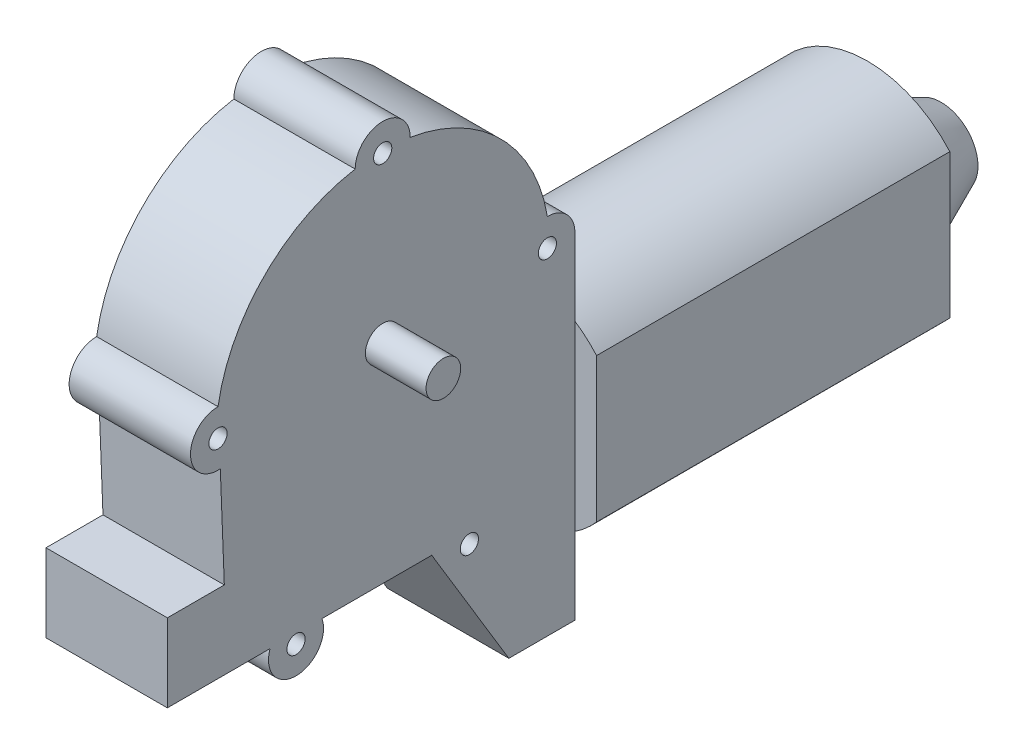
from build123d import *

# Parameters (mm, degrees)
BOSS_EXTRUDE1_DEPTH      = 14
BOSS_EXTRUDE1_DEPTH_BACK = 14
SKETCH1_R                = 2.1
SKETCH1_R_2              = 4
BOSS_EXTRUDE2_DEPTH      = 19
BOSS_EXTRUDE2_DEPTH_BACK = 19
SKETCH1_3_W              = 81.5
SKETCH1_3_H              = 50.5
SKETCH2_OUTSIDE_W        = 83.408
SKETCH2_OUTSIDE_H        = 167.258
SKETCH2_OUTSIDE_R        = 25.25
CUT_EXTRUDE1_DEPTH       = 81.5
SKETCH3_R                = 13.85
BOSS_EXTRUDE3_DEPTH      = 17
CHAMFER1_SIZE            = 12
CHAMFER1_SIZE2           = 5.342744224
BOSS_EXTRUDE4_DEPTH      = 28
BOSS_EXTRUDE4_DEPTH_BACK = 28
SKETCH1_4_R              = 4


with BuildPart() as part:
    # Sketch1 → Boss-Extrude1 (new, two sides: drawn at the far end of the back side and taken through both)
    with BuildSketch(Plane(origin=(0, 0, 0), x_dir=(0, 0, -1), z_dir=(1, 0, 0)).offset(-BOSS_EXTRUDE1_DEPTH_BACK)):
        with BuildLine():
            ThreePointArc((44.35, 0), (42.490128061, 4.490128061), (38, 6.35))
            ThreePointArc((38, 6.35), (27.24263662, 27.24263662), (6.35, 38))
            ThreePointArc((6.35, 38), (0, 44.35), (-6.35, 38))
            ThreePointArc((-6.35, 38), (-27.24263662, 27.24263662), (-38, 6.35))
            ThreePointArc((-38, 6.35), (-44.344446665, -0.265511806), (-37.469440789, -6.327796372))
            Line((-37.469440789, -6.327796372), (-36.544877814, -30))
            Line((-36.544877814, -30), (-49.689084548, -30))
            Line((-49.689084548, -30), (-49.689084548, -48))
            Line((-49.689084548, -48), (-25.992703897, -48))
            ThreePointArc((-25.992703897, -48), (-20, -56.45), (-14.007296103, -48))
            Line((-14.007296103, -48), (11.318236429, -48))
            Line((11.318236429, -48), (29.108576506, -77.5))
            Line((29.108576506, -77.5), (44.35, -77.5))
            Line((44.35, -77.5), (44.35, 0))
        make_face()
        with Locations((38, 0)):
            Circle(SKETCH1_R, mode=Mode.SUBTRACT)
        Circle(SKETCH1_R_2, mode=Mode.SUBTRACT)
        with Locations((20, -50.1)):
            Circle(SKETCH1_R, mode=Mode.SUBTRACT)
        with Locations((0, 38)):
            Circle(SKETCH1_R, mode=Mode.SUBTRACT)
        with Locations((-38, 0)):
            Circle(SKETCH1_R, mode=Mode.SUBTRACT)
        with Locations((-20, -50.1)):
            Circle(SKETCH1_R, mode=Mode.SUBTRACT)
    extrude(amount=BOSS_EXTRUDE1_DEPTH + BOSS_EXTRUDE1_DEPTH_BACK)

    # Sketch1_3 → Boss-Extrude2 (add, two sides: drawn at the far end of the back side and taken through both)
    with BuildSketch(Plane(origin=(0, 0, 0), x_dir=(0, 0, -1), z_dir=(1, 0, 0)).offset(-BOSS_EXTRUDE2_DEPTH_BACK)):
        with Locations((85.1, -38.75)):
            Rectangle(SKETCH1_3_W, SKETCH1_3_H)
    extrude(amount=BOSS_EXTRUDE2_DEPTH + BOSS_EXTRUDE2_DEPTH_BACK)

    # Sketch2 outside → Cut-Extrude1 (cut)
    with BuildSketch(Plane(origin=(0, 0, -125.85), x_dir=(-1, 0, 0), z_dir=(0, 0, -1))):
        with Locations((0, -16.575)):
            Rectangle(SKETCH2_OUTSIDE_W, SKETCH2_OUTSIDE_H)
        with Locations((0, -38.75)):
            Circle(SKETCH2_OUTSIDE_R, mode=Mode.SUBTRACT)
    extrude(amount=-CUT_EXTRUDE1_DEPTH, mode=Mode.SUBTRACT)

    # Sketch3 → Boss-Extrude3 (add)
    with BuildSketch(Plane(origin=(0, 0, -125.85), x_dir=(-1, 0, 0), z_dir=(0, 0, -1))):
        with Locations(Location((0, -38.75, 0), (0, 0, 180))):
            Circle(SKETCH3_R)
    extrude(amount=BOSS_EXTRUDE3_DEPTH)

    # Chamfer1
    chamfer1_edges = [part.edges().sort_by_distance(p)[0] for p in [
        (-13.85, -38.75, -142.85),
    ]]
    chamfer1_side = [part.faces().sort_by_distance(p)[0] for p in [
        (-13.85, -38.75, -134.35),
    ]]
    chamfer(chamfer1_edges, length=CHAMFER1_SIZE, length2=CHAMFER1_SIZE2, reference=chamfer1_side[0])

    # Sketch1_4 → Boss-Extrude4 (add, two sides: drawn at the far end of the back side and taken through both)
    with BuildSketch(Plane(origin=(0, 0, 0), x_dir=(0, 0, -1), z_dir=(1, 0, 0)).offset(-BOSS_EXTRUDE4_DEPTH_BACK)):
        Circle(SKETCH1_4_R)
    extrude(amount=BOSS_EXTRUDE4_DEPTH + BOSS_EXTRUDE4_DEPTH_BACK)


solid = part.part
